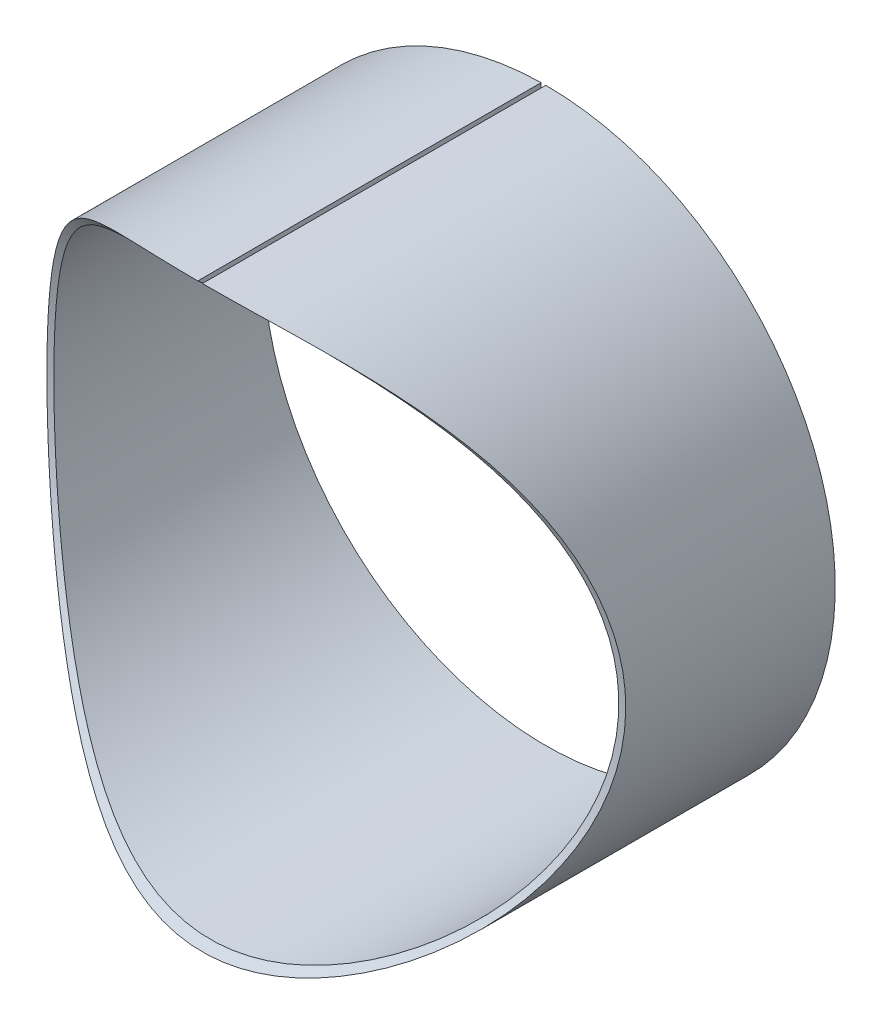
ISO-10303-21;
HEADER;
FILE_DESCRIPTION(('STEP AP214'),'2;1');
FILE_NAME('part.step','',(''),(''),'','','');
FILE_SCHEMA(('AUTOMOTIVE_DESIGN { 1 0 10303 214 1 1 1 1 }'));
ENDSEC;
DATA;
#1=APPLICATION_CONTEXT('core data for automotive mechanical design processes');
#2=APPLICATION_PROTOCOL_DEFINITION('international standard','automotive_design',2000,#1);
#3=PRODUCT_CONTEXT('',#1,'mechanical');
#4=PRODUCT('Part','Part','',(#3));
#5=PRODUCT_RELATED_PRODUCT_CATEGORY('part','',(#4));
#6=PRODUCT_DEFINITION_FORMATION('','',#4);
#7=PRODUCT_DEFINITION_CONTEXT('part definition',#1,'design');
#8=PRODUCT_DEFINITION('design','',#6,#7);
#9=PRODUCT_DEFINITION_SHAPE('','',#8);
#10=(LENGTH_UNIT() NAMED_UNIT(*) SI_UNIT(.MILLI.,.METRE.));
#11=(NAMED_UNIT(*) PLANE_ANGLE_UNIT() SI_UNIT($,.RADIAN.));
#12=(NAMED_UNIT(*) SI_UNIT($,.STERADIAN.) SOLID_ANGLE_UNIT());
#13=UNCERTAINTY_MEASURE_WITH_UNIT(LENGTH_MEASURE(1.E-05),#10,'distance_accuracy_value','');
#14=(GEOMETRIC_REPRESENTATION_CONTEXT(3) GLOBAL_UNCERTAINTY_ASSIGNED_CONTEXT((#13)) GLOBAL_UNIT_ASSIGNED_CONTEXT((#10,
#11,#12)) REPRESENTATION_CONTEXT('',''));
#15=CARTESIAN_POINT('',(0.,0.,0.));
#16=DIRECTION('',(0.,0.,1.));
#17=DIRECTION('',(1.,0.,0.));
#18=AXIS2_PLACEMENT_3D('',#15,#16,#17);
#19=CARTESIAN_POINT('',(0.,-79.9999999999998,0.));
#20=DIRECTION('',(0.,0.,1.));
#21=DIRECTION('',(1.,0.,0.));
#22=AXIS2_PLACEMENT_3D('',#19,#20,#21);
#23=PLANE('',#22);
#24=CARTESIAN_POINT('',(0.,-79.9999999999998,0.));
#25=DIRECTION('',(0.,0.,1.));
#26=DIRECTION('',(1.,0.,0.));
#27=AXIS2_PLACEMENT_3D('',#24,#25,#26);
#28=CIRCLE('',#27,61.);
#29=CARTESIAN_POINT('',(-1.,-19.0081972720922,0.));
#30=VERTEX_POINT('',#29);
#31=CARTESIAN_POINT('',(0.,-18.9999999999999,0.));
#32=VERTEX_POINT('',#31);
#33=EDGE_CURVE('E90',#30,#32,#28,.T.);
#34=ORIENTED_EDGE('',*,*,#33,.T.);
#35=DIRECTION('',(0.,-1.,0.));
#36=VECTOR('',#35,1.);
#37=CARTESIAN_POINT('',(0.,-79.9999999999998,0.));
#38=LINE('',#37,#36);
#39=CARTESIAN_POINT('',(0.,-17.4999999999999,0.));
#40=VERTEX_POINT('',#39);
#41=EDGE_CURVE('E93',#40,#32,#38,.T.);
#42=ORIENTED_EDGE('',*,*,#41,.F.);
#43=CARTESIAN_POINT('',(0.,-79.9999999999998,0.));
#44=DIRECTION('',(0.,0.,1.));
#45=DIRECTION('',(1.,0.,0.));
#46=AXIS2_PLACEMENT_3D('',#43,#44,#45);
#47=CIRCLE('',#46,62.5);
#48=CARTESIAN_POINT('',(-1.,-17.5080005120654,0.));
#49=VERTEX_POINT('',#48);
#50=EDGE_CURVE('E92',#49,#40,#47,.T.);
#51=ORIENTED_EDGE('',*,*,#50,.F.);
#52=DIRECTION('',(0.,1.,0.));
#53=VECTOR('',#52,1.);
#54=CARTESIAN_POINT('',(-1.,-79.9999999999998,0.));
#55=LINE('',#54,#53);
#56=EDGE_CURVE('E80',#30,#49,#55,.T.);
#57=ORIENTED_EDGE('',*,*,#56,.F.);
#58=EDGE_LOOP('',(#34,#42,#51,#57));
#59=FACE_BOUND('',#58,.T.);
#60=ADVANCED_FACE('F38',(#59),#23,.F.);
#61=CARTESIAN_POINT('',(0.,-79.9999999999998,127.235502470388));
#62=DIRECTION('',(0.,0.,-1.));
#63=DIRECTION('',(-1.,0.,0.));
#64=AXIS2_PLACEMENT_3D('',#61,#62,#63);
#65=CYLINDRICAL_SURFACE('',#64,62.5);
#66=ORIENTED_EDGE('',*,*,#50,.T.);
#67=DIRECTION('',(0.,0.,-1.));
#68=VECTOR('',#67,1.);
#69=CARTESIAN_POINT('',(0.,-17.4999999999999,127.235502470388));
#70=LINE('',#69,#68);
#71=CARTESIAN_POINT('',(0.,-17.4999999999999,74.1520194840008));
#72=VERTEX_POINT('',#71);
#73=EDGE_CURVE('E97',#40,#72,#70,.F.);
#74=ORIENTED_EDGE('',*,*,#73,.T.);
#75=CARTESIAN_POINT('',(-62.5,-79.9999999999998,45.234502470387));
#76=CARTESIAN_POINT('',(-62.4999996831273,-79.2396670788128,45.234502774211));
#77=CARTESIAN_POINT('',(-62.4861200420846,-78.4793250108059,45.2450831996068));
#78=CARTESIAN_POINT('',(-62.4306589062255,-76.9601555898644,45.287343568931));
#79=CARTESIAN_POINT('',(-62.3890741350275,-76.2013284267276,45.3190260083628));
#80=CARTESIAN_POINT('',(-62.2783644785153,-74.6866054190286,45.4033140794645));
#81=CARTESIAN_POINT('',(-62.2092306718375,-73.9307106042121,45.4559264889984));
#82=CARTESIAN_POINT('',(-62.0437126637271,-72.4235548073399,45.5817658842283));
#83=CARTESIAN_POINT('',(-61.9473254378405,-71.6722943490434,45.6549951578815));
#84=CARTESIAN_POINT('',(-61.7275392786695,-70.1748039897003,45.8217640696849));
#85=CARTESIAN_POINT('',(-61.6040986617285,-69.4285837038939,45.9153350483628));
#86=CARTESIAN_POINT('',(-61.3307846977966,-67.9436799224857,46.122190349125));
#87=CARTESIAN_POINT('',(-61.180908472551,-67.2049972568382,46.2354768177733));
#88=CARTESIAN_POINT('',(-60.8553509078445,-65.7367064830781,46.4810981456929));
#89=CARTESIAN_POINT('',(-60.6796751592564,-65.007096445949,46.6134288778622));
#90=CARTESIAN_POINT('',(-60.3031549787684,-63.5579737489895,46.8964347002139));
#91=CARTESIAN_POINT('',(-60.1023079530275,-62.8384621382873,47.0471116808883));
#92=CARTESIAN_POINT('',(-59.4656531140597,-60.7054989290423,47.523558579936));
#93=CARTESIAN_POINT('',(-58.9936715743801,-59.3083855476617,47.8753046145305));
#94=CARTESIAN_POINT('',(-57.9590827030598,-56.5661879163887,48.6413444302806));
#95=CARTESIAN_POINT('',(-57.3964734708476,-55.2211047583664,49.0556395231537));
#96=CARTESIAN_POINT('',(-56.186943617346,-52.5887873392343,49.9392754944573));
#97=CARTESIAN_POINT('',(-55.5400489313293,-51.3015354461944,50.408599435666));
#98=CARTESIAN_POINT('',(-54.1678011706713,-48.7886354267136,51.3947172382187));
#99=CARTESIAN_POINT('',(-53.4424448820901,-47.5629898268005,51.9115130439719));
#100=CARTESIAN_POINT('',(-51.8477055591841,-45.0648967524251,53.0348742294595));
#101=CARTESIAN_POINT('',(-50.9711993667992,-43.7987436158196,53.6453167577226));
#102=CARTESIAN_POINT('',(-49.1372999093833,-41.3461405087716,54.9034646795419));
#103=CARTESIAN_POINT('',(-48.1799023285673,-40.1596947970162,55.5511720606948));
#104=CARTESIAN_POINT('',(-46.1881333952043,-37.8666884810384,56.8744375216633));
#105=CARTESIAN_POINT('',(-45.1536599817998,-36.7602377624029,57.5500319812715));
#106=CARTESIAN_POINT('',(-43.0127936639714,-34.6300762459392,58.917800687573));
#107=CARTESIAN_POINT('',(-41.9063972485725,-33.6063694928,59.6099757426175));
#108=CARTESIAN_POINT('',(-40.0755370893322,-32.0309468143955,60.7251070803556));
#109=CARTESIAN_POINT('',(-39.3728446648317,-31.4525246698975,61.1464029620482));
#110=CARTESIAN_POINT('',(-37.9425726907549,-30.3266718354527,61.9883956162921));
#111=CARTESIAN_POINT('',(-37.2149917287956,-29.7792429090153,62.4090923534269));
#112=CARTESIAN_POINT('',(-35.7350617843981,-28.7156355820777,63.2472179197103));
#113=CARTESIAN_POINT('',(-34.9827044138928,-28.1994679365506,63.664645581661));
#114=CARTESIAN_POINT('',(-33.4537055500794,-27.1991085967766,64.4930684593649));
#115=CARTESIAN_POINT('',(-32.6770666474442,-26.7149135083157,64.9040643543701));
#116=CARTESIAN_POINT('',(-31.1001722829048,-25.779441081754,65.7160964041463));
#117=CARTESIAN_POINT('',(-30.2999370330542,-25.3281366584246,66.1171405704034));
#118=CARTESIAN_POINT('',(-28.675241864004,-24.4587594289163,66.9061080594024));
#119=CARTESIAN_POINT('',(-27.8507811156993,-24.0406877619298,67.2940309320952));
#120=CARTESIAN_POINT('',(-26.1780964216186,-23.2389485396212,68.0526855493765));
#121=CARTESIAN_POINT('',(-25.329884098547,-22.8552645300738,68.4234254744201));
#122=CARTESIAN_POINT('',(-23.6095988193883,-22.123315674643,69.1435992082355));
#123=CARTESIAN_POINT('',(-22.7375286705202,-21.7750466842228,69.4930355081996));
#124=CARTESIAN_POINT('',(-20.7061923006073,-21.0169243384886,70.2663464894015));
#125=CARTESIAN_POINT('',(-19.5387859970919,-20.6196471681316,70.6813718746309));
#126=CARTESIAN_POINT('',(-17.165998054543,-19.8907766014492,71.4566882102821));
#127=CARTESIAN_POINT('',(-15.9606219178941,-19.5591737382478,71.8169870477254));
#128=CARTESIAN_POINT('',(-13.5171941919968,-18.9663088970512,72.4706146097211));
#129=CARTESIAN_POINT('',(-12.279213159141,-18.7049068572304,72.7640765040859));
#130=CARTESIAN_POINT('',(-10.4006924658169,-18.3681826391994,73.1461703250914));
#131=CARTESIAN_POINT('',(-9.77083487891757,-18.2651601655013,73.2638645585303));
#132=CARTESIAN_POINT('',(-8.50484647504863,-18.0780588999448,73.4786323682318));
#133=CARTESIAN_POINT('',(-7.86871639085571,-17.9939779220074,73.5757083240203));
#134=CARTESIAN_POINT('',(-6.58461862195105,-17.8444291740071,73.7490067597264));
#135=CARTESIAN_POINT('',(-5.93659662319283,-17.7791639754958,73.825001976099));
#136=CARTESIAN_POINT('',(-4.63661252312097,-17.6688097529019,73.9538311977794));
#137=CARTESIAN_POINT('',(-3.98465091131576,-17.6237182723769,74.006668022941));
#138=CARTESIAN_POINT('',(-2.67807370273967,-17.5539756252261,74.0885060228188));
#139=CARTESIAN_POINT('',(-2.02345785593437,-17.5293264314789,74.1175048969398));
#140=CARTESIAN_POINT('',(-0.713223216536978,-17.5006348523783,74.1512673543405));
#141=CARTESIAN_POINT('',(-0.0576045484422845,-17.4965900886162,74.1560337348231));
#142=CARTESIAN_POINT('',(1.25333302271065,-17.5091291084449,74.1412717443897));
#143=CARTESIAN_POINT('',(1.90865180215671,-17.5257182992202,74.1217370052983));
#144=CARTESIAN_POINT('',(3.21725416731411,-17.5794255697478,74.0586283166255));
#145=CARTESIAN_POINT('',(3.87053783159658,-17.6165428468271,74.0150553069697));
#146=CARTESIAN_POINT('',(5.17361279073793,-17.7110731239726,73.9044463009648));
#147=CARTESIAN_POINT('',(5.82340423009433,-17.7684852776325,73.8374112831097));
#148=CARTESIAN_POINT('',(7.11819315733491,-17.9032594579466,73.6807407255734));
#149=CARTESIAN_POINT('',(7.76319019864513,-17.9806233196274,73.5911031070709));
#150=CARTESIAN_POINT('',(9.53656887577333,-18.2213090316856,73.3137388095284));
#151=CARTESIAN_POINT('',(10.6587197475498,-18.4052064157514,73.103320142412));
#152=CARTESIAN_POINT('',(12.8789517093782,-18.8308818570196,72.6227678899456));
#153=CARTESIAN_POINT('',(13.9770297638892,-19.0726671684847,72.3526268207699));
#154=CARTESIAN_POINT('',(15.6035792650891,-19.476525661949,71.9086582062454));
#155=CARTESIAN_POINT('',(16.1425907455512,-19.6180871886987,71.7541248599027));
#156=CARTESIAN_POINT('',(17.213218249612,-19.914531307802,71.4332104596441));
#157=CARTESIAN_POINT('',(17.7448360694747,-20.0694105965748,71.2668323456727));
#158=CARTESIAN_POINT('',(19.3286724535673,-20.5536243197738,70.7513137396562));
#159=CARTESIAN_POINT('',(20.3697092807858,-20.9024935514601,70.3858345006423));
#160=CARTESIAN_POINT('',(22.2383365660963,-21.583286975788,69.6872911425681));
#161=CARTESIAN_POINT('',(23.0710346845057,-21.907241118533,69.3599756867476));
#162=CARTESIAN_POINT('',(24.7148904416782,-22.5873245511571,68.6852574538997));
#163=CARTESIAN_POINT('',(25.5260478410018,-22.9434541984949,68.3378544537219));
#164=CARTESIAN_POINT('',(27.1270137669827,-23.6869947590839,67.6265307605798));
#165=CARTESIAN_POINT('',(27.9168114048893,-24.0744212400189,67.2626018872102));
#166=CARTESIAN_POINT('',(29.4745699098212,-24.8795101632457,66.5218114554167));
#167=CARTESIAN_POINT('',(30.2425313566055,-25.297171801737,66.1449502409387));
#168=CARTESIAN_POINT('',(31.7581854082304,-26.1629225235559,65.3806169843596));
#169=CARTESIAN_POINT('',(32.5058329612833,-26.6110725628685,64.9931246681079));
#170=CARTESIAN_POINT('',(33.9791723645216,-27.5364637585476,64.2111368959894));
#171=CARTESIAN_POINT('',(34.7048622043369,-28.0137075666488,63.8166408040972));
#172=CARTESIAN_POINT('',(36.8484479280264,-29.4881170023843,62.6268942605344));
#173=CARTESIAN_POINT('',(38.2334653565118,-30.5283071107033,61.8250759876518));
#174=CARTESIAN_POINT('',(40.9530894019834,-32.7530689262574,60.1995652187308));
#175=CARTESIAN_POINT('',(42.2849590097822,-33.9410224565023,59.375933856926));
#176=CARTESIAN_POINT('',(44.8488769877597,-36.433676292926,57.7493221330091));
#177=CARTESIAN_POINT('',(46.0809152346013,-37.7383884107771,56.9463438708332));
#178=CARTESIAN_POINT('',(48.4364247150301,-40.4601907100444,55.3800300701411));
#179=CARTESIAN_POINT('',(49.5600696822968,-41.8770942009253,54.6166320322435));
#180=CARTESIAN_POINT('',(51.6920034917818,-44.8220348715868,53.1452417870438));
#181=CARTESIAN_POINT('',(52.7003195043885,-46.3500457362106,52.4372365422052));
#182=CARTESIAN_POINT('',(54.4114237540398,-49.2124152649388,51.2209286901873));
#183=CARTESIAN_POINT('',(55.1358941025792,-50.5285669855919,50.7002129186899));
#184=CARTESIAN_POINT('',(56.4952754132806,-53.2265933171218,49.7151714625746));
#185=CARTESIAN_POINT('',(57.1301956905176,-54.6084610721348,49.2508399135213));
#186=CARTESIAN_POINT('',(58.3033010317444,-57.4320994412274,48.3873894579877));
#187=CARTESIAN_POINT('',(58.8415226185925,-58.8738471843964,47.9882459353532));
#188=CARTESIAN_POINT('',(59.5710711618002,-61.075515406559,47.4445504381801));
#189=CARTESIAN_POINT('',(59.8013195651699,-61.816029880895,47.2724662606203));
#190=CARTESIAN_POINT('',(60.2350743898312,-63.3089916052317,46.9475577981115));
#191=CARTESIAN_POINT('',(60.4385837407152,-64.0614375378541,46.7947314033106));
#192=CARTESIAN_POINT('',(60.8193992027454,-65.5823175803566,46.5082149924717));
#193=CARTESIAN_POINT('',(60.9965119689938,-66.3508267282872,46.3746663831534));
#194=CARTESIAN_POINT('',(61.3220659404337,-67.8971733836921,46.1288036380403));
#195=CARTESIAN_POINT('',(61.4705105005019,-68.675009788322,46.0164870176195));
#196=CARTESIAN_POINT('',(61.7381190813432,-70.2386534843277,45.8137574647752));
#197=CARTESIAN_POINT('',(61.8572790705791,-71.0244618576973,45.7233475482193));
#198=CARTESIAN_POINT('',(62.0657354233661,-72.6021915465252,45.5650411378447));
#199=CARTESIAN_POINT('',(62.1550354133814,-73.3941121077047,45.497141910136));
#200=CARTESIAN_POINT('',(62.3033478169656,-74.9821688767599,45.3843049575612));
#201=CARTESIAN_POINT('',(62.3623695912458,-75.7783037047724,45.3393601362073));
#202=CARTESIAN_POINT('',(62.4498779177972,-77.3731291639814,45.272703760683));
#203=CARTESIAN_POINT('',(62.4783680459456,-78.1718194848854,45.2509894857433));
#204=CARTESIAN_POINT('',(62.5046860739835,-79.7699815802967,45.2309311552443));
#205=CARTESIAN_POINT('',(62.5025146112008,-80.5694533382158,45.2325866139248));
#206=CARTESIAN_POINT('',(62.4675221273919,-82.1673180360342,45.2592550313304));
#207=CARTESIAN_POINT('',(62.4347018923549,-82.9657110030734,45.2842673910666));
#208=CARTESIAN_POINT('',(62.3438867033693,-84.4714676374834,45.3534335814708));
#209=CARTESIAN_POINT('',(62.2890761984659,-85.1791364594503,45.3951654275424));
#210=CARTESIAN_POINT('',(62.1555524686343,-86.5909270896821,45.4967457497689));
#211=CARTESIAN_POINT('',(62.0768372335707,-87.2950485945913,45.5565957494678));
#212=CARTESIAN_POINT('',(61.8052640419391,-89.3999672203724,45.7628729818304));
#213=CARTESIAN_POINT('',(61.576947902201,-90.793823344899,45.9360509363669));
#214=CARTESIAN_POINT('',(61.0290357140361,-93.5531021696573,46.3502569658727));
#215=CARTESIAN_POINT('',(60.7094291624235,-94.9185215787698,46.5912928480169));
#216=CARTESIAN_POINT('',(59.9831317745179,-97.6130897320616,47.13663375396));
#217=CARTESIAN_POINT('',(59.5764368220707,-98.9422367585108,47.4409417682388));
#218=CARTESIAN_POINT('',(58.6700576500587,-101.588833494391,48.1154035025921));
#219=CARTESIAN_POINT('',(58.1683788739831,-102.905239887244,48.4869601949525));
#220=CARTESIAN_POINT('',(57.0842469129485,-105.487241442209,49.2843493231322));
#221=CARTESIAN_POINT('',(56.5017933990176,-106.752836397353,49.7101819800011));
#222=CARTESIAN_POINT('',(55.2615889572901,-109.228824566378,50.6093706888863));
#223=CARTESIAN_POINT('',(54.6038406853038,-110.43921972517,51.0827250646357));
#224=CARTESIAN_POINT('',(53.218028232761,-112.801942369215,52.0702020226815));
#225=CARTESIAN_POINT('',(52.4899547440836,-113.954262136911,52.5843300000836));
#226=CARTESIAN_POINT('',(51.2865363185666,-115.729028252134,53.4242155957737));
#227=CARTESIAN_POINT('',(50.8328035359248,-116.37157410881,53.7388538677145));
#228=CARTESIAN_POINT('',(49.9040644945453,-117.635745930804,54.378121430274));
#229=CARTESIAN_POINT('',(49.4290624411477,-118.257375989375,54.7027487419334));
#230=CARTESIAN_POINT('',(47.9730061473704,-120.090860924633,55.6897666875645));
#231=CARTESIAN_POINT('',(46.9609208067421,-121.271282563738,56.3652799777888));
#232=CARTESIAN_POINT('',(44.8576568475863,-123.548224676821,57.7411544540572));
#233=CARTESIAN_POINT('',(43.7663366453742,-124.64458738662,58.4415589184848));
#234=CARTESIAN_POINT('',(41.5097700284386,-126.750082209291,59.8547087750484));
#235=CARTESIAN_POINT('',(40.3445209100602,-127.759211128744,60.5674546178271));
#236=CARTESIAN_POINT('',(38.4225207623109,-129.303303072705,61.7081427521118));
#237=CARTESIAN_POINT('',(37.6884509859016,-129.866700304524,62.1361629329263));
#238=CARTESIAN_POINT('',(36.1948605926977,-130.961154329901,62.98933142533));
#239=CARTESIAN_POINT('',(35.4353391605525,-131.492210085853,63.4144796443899));
#240=CARTESIAN_POINT('',(33.8908391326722,-132.521639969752,64.2589457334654));
#241=CARTESIAN_POINT('',(33.1058514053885,-133.020002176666,64.6782614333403));
#242=CARTESIAN_POINT('',(31.5107865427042,-133.983222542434,65.5075592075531));
#243=CARTESIAN_POINT('',(30.7007098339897,-134.448081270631,65.9175414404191));
#244=CARTESIAN_POINT('',(29.0568818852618,-135.342766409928,66.7238403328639));
#245=CARTESIAN_POINT('',(28.223172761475,-135.772650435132,67.1201788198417));
#246=CARTESIAN_POINT('',(26.530785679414,-136.597292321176,67.8959234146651));
#247=CARTESIAN_POINT('',(25.6721066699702,-136.992048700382,68.2753288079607));
#248=CARTESIAN_POINT('',(23.9305141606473,-137.744954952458,69.0125343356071));
#249=CARTESIAN_POINT('',(23.047617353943,-138.103129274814,69.3703488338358));
#250=CARTESIAN_POINT('',(21.257432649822,-138.781696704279,70.0598041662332));
#251=CARTESIAN_POINT('',(20.3501455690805,-139.102091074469,70.3914458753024));
#252=CARTESIAN_POINT('',(18.2953116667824,-139.774232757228,71.0977813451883));
#253=CARTESIAN_POINT('',(17.1414814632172,-140.115607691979,71.4642333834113));
#254=CARTESIAN_POINT('',(14.8001567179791,-140.734430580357,72.1387792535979));
#255=CARTESIAN_POINT('',(13.6126677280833,-141.011889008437,72.4468826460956));
#256=CARTESIAN_POINT('',(11.210586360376,-141.498543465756,72.9937134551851));
#257=CARTESIAN_POINT('',(9.99605598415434,-141.707881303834,73.2325848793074));
#258=CARTESIAN_POINT('',(7.5439976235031,-142.055386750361,73.6322682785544));
#259=CARTESIAN_POINT('',(6.3064697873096,-142.193554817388,73.793080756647));
#260=CARTESIAN_POINT('',(3.80751479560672,-142.396602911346,74.0302838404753));
#261=CARTESIAN_POINT('',(2.54597681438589,-142.46090769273,74.1060117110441));
#262=CARTESIAN_POINT('',(0.0191570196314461,-142.51276988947,74.1670426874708));
#263=CARTESIAN_POINT('',(-1.24612464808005,-142.5003302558,74.1523492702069));
#264=CARTESIAN_POINT('',(-3.77031434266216,-142.398970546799,74.0332390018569));
#265=CARTESIAN_POINT('',(-5.02921658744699,-142.309990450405,73.9287517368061));
#266=CARTESIAN_POINT('',(-7.52950056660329,-142.057523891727,73.6350551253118));
#267=CARTESIAN_POINT('',(-8.77088001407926,-141.894027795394,73.4458348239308));
#268=CARTESIAN_POINT('',(-11.410977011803,-141.466123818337,72.9571023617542));
#269=CARTESIAN_POINT('',(-12.8055711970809,-141.190308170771,72.6453558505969));
#270=CARTESIAN_POINT('',(-15.5520628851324,-140.550583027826,71.9366370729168));
#271=CARTESIAN_POINT('',(-16.9039521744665,-140.186656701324,71.5396485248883));
#272=CARTESIAN_POINT('',(-19.5628512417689,-139.375763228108,70.6759478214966));
#273=CARTESIAN_POINT('',(-20.8697576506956,-138.928618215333,70.209086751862));
#274=CARTESIAN_POINT('',(-23.4335021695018,-137.956886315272,69.2217556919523));
#275=CARTESIAN_POINT('',(-24.690336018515,-137.432292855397,68.7012811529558));
#276=CARTESIAN_POINT('',(-26.7828204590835,-136.478547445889,67.7830853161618));
#277=CARTESIAN_POINT('',(-27.6315516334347,-136.068081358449,67.3954714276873));
#278=CARTESIAN_POINT('',(-29.3041084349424,-135.212332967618,66.6049924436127));
#279=CARTESIAN_POINT('',(-30.1279320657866,-134.767047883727,66.202126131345));
#280=CARTESIAN_POINT('',(-31.7507766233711,-133.842460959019,65.3849249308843));
#281=CARTESIAN_POINT('',(-32.5497898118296,-133.363148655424,64.9705865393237));
#282=CARTESIAN_POINT('',(-34.1226798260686,-132.371338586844,64.1340765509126));
#283=CARTESIAN_POINT('',(-34.8965572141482,-131.858841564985,63.7119051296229));
#284=CARTESIAN_POINT('',(-36.419753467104,-130.800711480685,62.8625488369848));
#285=CARTESIAN_POINT('',(-37.1690488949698,-130.255048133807,62.4353596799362));
#286=CARTESIAN_POINT('',(-38.6421275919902,-129.131397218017,61.5793065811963));
#287=CARTESIAN_POINT('',(-39.3659085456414,-128.553406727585,61.1504424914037));
#288=CARTESIAN_POINT('',(-40.7873775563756,-127.36557328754,60.2939433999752));
#289=CARTESIAN_POINT('',(-41.4850699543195,-126.755735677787,59.8663082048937));
#290=CARTESIAN_POINT('',(-42.8538528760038,-125.504472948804,59.0148879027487));
#291=CARTESIAN_POINT('',(-43.524943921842,-124.863048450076,58.5911027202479));
#292=CARTESIAN_POINT('',(-45.5189097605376,-122.870150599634,57.31552084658));
#293=CARTESIAN_POINT('',(-46.7993704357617,-121.469312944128,56.4735567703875));
#294=CARTESIAN_POINT('',(-49.2396799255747,-118.540066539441,54.8364484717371));
#295=CARTESIAN_POINT('',(-50.3995128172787,-117.011640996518,54.041310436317));
#296=CARTESIAN_POINT('',(-52.0389403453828,-114.628407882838,52.8997964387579));
#297=CARTESIAN_POINT('',(-52.5683345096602,-113.819541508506,52.5280849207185));
#298=CARTESIAN_POINT('',(-53.5925238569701,-112.171913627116,51.8038897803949));
#299=CARTESIAN_POINT('',(-54.0873237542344,-111.333156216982,51.4514035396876));
#300=CARTESIAN_POINT('',(-55.0404543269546,-109.626896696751,50.7682271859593));
#301=CARTESIAN_POINT('',(-55.4987960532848,-108.759403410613,50.4375304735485));
#302=CARTESIAN_POINT('',(-56.3772558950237,-106.996753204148,49.8003135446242));
#303=CARTESIAN_POINT('',(-56.7973775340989,-106.101598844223,49.4937910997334));
#304=CARTESIAN_POINT('',(-57.7756984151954,-103.880450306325,48.7767026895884));
#305=CARTESIAN_POINT('',(-58.3121010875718,-102.540067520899,48.3805697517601));
#306=CARTESIAN_POINT('',(-59.2951488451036,-99.8100772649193,47.6508599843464));
#307=CARTESIAN_POINT('',(-59.7417991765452,-98.4204726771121,47.3172794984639));
#308=CARTESIAN_POINT('',(-60.3397160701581,-96.3065683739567,46.8689988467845));
#309=CARTESIAN_POINT('',(-60.5268744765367,-95.5976749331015,46.7283578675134));
#310=CARTESIAN_POINT('',(-60.8767837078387,-94.170626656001,46.4649569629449));
#311=CARTESIAN_POINT('',(-61.0395369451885,-93.4524727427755,46.3421952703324));
#312=CARTESIAN_POINT('',(-61.3400003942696,-92.0082586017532,46.1152324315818));
#313=CARTESIAN_POINT('',(-61.477717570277,-91.2822006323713,46.011026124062));
#314=CARTESIAN_POINT('',(-61.7276296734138,-89.8233060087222,45.8217049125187));
#315=CARTESIAN_POINT('',(-61.83982739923,-89.0904701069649,45.7365879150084));
#316=CARTESIAN_POINT('',(-62.0320848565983,-87.6651705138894,45.5906056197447));
#317=CARTESIAN_POINT('',(-62.1137122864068,-86.9730387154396,45.5285590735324));
#318=CARTESIAN_POINT('',(-62.253844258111,-85.5852604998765,45.4219786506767));
#319=CARTESIAN_POINT('',(-62.3123544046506,-84.8896149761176,45.3774405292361));
#320=CARTESIAN_POINT('',(-62.4060751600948,-83.4956892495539,45.3060745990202));
#321=CARTESIAN_POINT('',(-62.4412804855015,-82.7974084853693,45.2792508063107));
#322=CARTESIAN_POINT('',(-62.4882461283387,-81.3994212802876,45.2434622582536));
#323=CARTESIAN_POINT('',(-62.5000002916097,-80.6997145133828,45.2345021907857));
#324=CARTESIAN_POINT('',(-62.5,-79.9999999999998,45.234502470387));
#325=B_SPLINE_CURVE_WITH_KNOTS('',3,(#75,#76,#77,#78,#79,#80,#81,#82,#83,#84,#85,#86,#87,#88,
#89,#90,#91,#92,#93,#94,#95,#96,#97,#98,#99,#100,#101,#102,#103,#104,#105,#106,#107,#108,#109,
#110,#111,#112,#113,#114,#115,#116,#117,#118,#119,#120,#121,#122,#123,#124,#125,#126,#127,#128,
#129,#130,#131,#132,#133,#134,#135,#136,#137,#138,#139,#140,#141,#142,#143,#144,#145,#146,#147,
#148,#149,#150,#151,#152,#153,#154,#155,#156,#157,#158,#159,#160,#161,#162,#163,#164,#165,#166,
#167,#168,#169,#170,#171,#172,#173,#174,#175,#176,#177,#178,#179,#180,#181,#182,#183,#184,#185,
#186,#187,#188,#189,#190,#191,#192,#193,#194,#195,#196,#197,#198,#199,#200,#201,#202,#203,#204,
#205,#206,#207,#208,#209,#210,#211,#212,#213,#214,#215,#216,#217,#218,#219,#220,#221,#222,#223,
#224,#225,#226,#227,#228,#229,#230,#231,#232,#233,#234,#235,#236,#237,#238,#239,#240,#241,#242,
#243,#244,#245,#246,#247,#248,#249,#250,#251,#252,#253,#254,#255,#256,#257,#258,#259,#260,#261,
#262,#263,#264,#265,#266,#267,#268,#269,#270,#271,#272,#273,#274,#275,#276,#277,#278,#279,#280,
#281,#282,#283,#284,#285,#286,#287,#288,#289,#290,#291,#292,#293,#294,#295,#296,#297,#298,#299,
#300,#301,#302,#303,#304,#305,#306,#307,#308,#309,#310,#311,#312,#313,#314,#315,#316,#317,#318,
#319,#320,#321,#322,#323,#324),.UNSPECIFIED.,.T.,.F.,(4,2,2,2,2,2,2,2,2,2,2,2,2,2,2,2,2,2,2,2,2,
2,2,2,2,2,2,2,2,2,2,2,2,2,2,2,2,2,2,2,2,2,2,2,2,2,2,2,2,2,2,2,2,2,2,2,2,2,2,2,2,2,2,2,2,2,2,2,2,
2,2,2,2,2,2,2,2,2,2,2,2,2,2,2,2,2,2,2,2,2,2,2,2,2,2,2,2,2,2,2,2,2,2,2,2,2,2,2,2,2,2,2,2,2,2,2,2,
2,2,2,2,2,2,2,4),(0.,2.2808148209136,4.56189941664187,6.84372331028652,9.1258005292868,
11.4114189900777,13.6972864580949,15.9826592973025,18.26826783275,22.8108132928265,
27.3534540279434,31.8947002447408,36.4361325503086,41.4010767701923,46.3662860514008,
51.3381910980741,56.3103390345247,59.318395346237,62.3266226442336,65.3358790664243,
68.3448155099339,71.3512454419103,74.3577783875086,77.3628649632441,80.367599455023,
84.2677581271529,88.1673541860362,92.0591111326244,94.0055517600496,95.9517676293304,
97.9182145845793,99.8844220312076,101.850819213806,103.816989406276,105.783674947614,
107.750283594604,109.716810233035,111.683517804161,115.149077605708,118.615071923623,
120.349751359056,122.084001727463,125.553028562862,128.406750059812,131.260503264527,
134.115684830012,136.970790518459,139.831782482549,142.693035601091,148.413258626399,
154.304151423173,160.195640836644,166.077524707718,171.958019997,176.723661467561,
181.488806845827,186.25214863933,188.634555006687,191.016700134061,193.415516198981,
195.814051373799,198.212916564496,200.611490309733,203.009322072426,205.406872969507,
207.80437403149,210.201813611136,212.334195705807,214.466757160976,218.730365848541,
222.994465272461,227.258766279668,231.625240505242,235.991732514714,240.358070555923,
244.724987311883,247.266032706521,249.806577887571,254.887777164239,259.978290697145,
265.068990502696,268.126909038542,271.184925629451,274.244051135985,277.303124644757,
280.357052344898,283.411108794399,286.463110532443,289.515010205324,293.285296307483,
297.054964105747,300.816733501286,304.578478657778,308.369325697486,312.16002697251,
315.953703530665,319.747870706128,324.107491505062,328.467945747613,332.837829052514,
337.208083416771,340.265173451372,343.322507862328,346.380786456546,349.438996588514,
352.500042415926,355.561365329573,358.622176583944,361.682927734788,367.903737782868,
374.125367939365,377.23150350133,380.337214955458,383.441981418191,386.546461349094,
391.033046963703,395.519370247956,397.758465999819,399.997340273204,402.235590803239,
404.473595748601,406.572053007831,408.670001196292,410.768424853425,412.867399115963),.UNSPECIFIED.);
#326=CARTESIAN_POINT('',(-1.,-17.5080005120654,74.1426010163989));
#327=VERTEX_POINT('',#326);
#328=EDGE_CURVE('E96',#72,#327,#325,.T.);
#329=ORIENTED_EDGE('',*,*,#328,.T.);
#330=DIRECTION('',(0.,0.,-1.));
#331=VECTOR('',#330,1.);
#332=CARTESIAN_POINT('',(-1.,-17.5080005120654,127.235502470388));
#333=LINE('',#332,#331);
#334=EDGE_CURVE('E54',#327,#49,#333,.T.);
#335=ORIENTED_EDGE('',*,*,#334,.T.);
#336=EDGE_LOOP('',(#66,#74,#329,#335));
#337=FACE_BOUND('',#336,.T.);
#338=ADVANCED_FACE('F111',(#337),#65,.T.);
#339=CARTESIAN_POINT('',(0.,-79.9999999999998,127.235502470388));
#340=DIRECTION('',(0.,0.,-1.));
#341=DIRECTION('',(-1.,0.,0.));
#342=AXIS2_PLACEMENT_3D('',#339,#340,#341);
#343=CYLINDRICAL_SURFACE('',#342,61.);
#344=DIRECTION('',(0.,0.,-1.));
#345=VECTOR('',#344,1.);
#346=CARTESIAN_POINT('',(0.,-18.9999999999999,127.235502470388));
#347=LINE('',#346,#345);
#348=CARTESIAN_POINT('',(0.,-18.9999999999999,72.4348674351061));
#349=VERTEX_POINT('',#348);
#350=EDGE_CURVE('E62',#32,#349,#347,.F.);
#351=ORIENTED_EDGE('',*,*,#350,.F.);
#352=ORIENTED_EDGE('',*,*,#33,.F.);
#353=DIRECTION('',(0.,0.,-1.));
#354=VECTOR('',#353,1.);
#355=CARTESIAN_POINT('',(-1.,-19.0081972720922,127.235502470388));
#356=LINE('',#355,#354);
#357=CARTESIAN_POINT('',(-1.,-19.0081972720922,72.4257440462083));
#358=VERTEX_POINT('',#357);
#359=EDGE_CURVE('E77',#358,#30,#356,.T.);
#360=ORIENTED_EDGE('',*,*,#359,.F.);
#361=CARTESIAN_POINT('',(-61.,-79.9999999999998,45.234502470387));
#362=CARTESIAN_POINT('',(-60.9999993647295,-79.253761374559,45.234503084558));
#363=CARTESIAN_POINT('',(-60.9863008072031,-78.5074994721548,45.2446949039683));
#364=CARTESIAN_POINT('',(-60.9315608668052,-77.0164526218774,45.2854037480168));
#365=CARTESIAN_POINT('',(-60.8905159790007,-76.271667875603,45.3159233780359));
#366=CARTESIAN_POINT('',(-60.7812267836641,-74.7847862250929,45.3971259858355));
#367=CARTESIAN_POINT('',(-60.7129675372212,-74.0426910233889,45.4478200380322));
#368=CARTESIAN_POINT('',(-60.5495292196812,-72.5630236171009,45.569072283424));
#369=CARTESIAN_POINT('',(-60.4543471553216,-71.8254519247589,45.6396326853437));
#370=CARTESIAN_POINT('',(-60.2372057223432,-70.3546415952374,45.8003842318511));
#371=CARTESIAN_POINT('',(-60.1151844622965,-69.6214170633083,45.8906207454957));
#372=CARTESIAN_POINT('',(-59.8449699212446,-68.1623420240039,46.0901118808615));
#373=CARTESIAN_POINT('',(-59.6967737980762,-67.4364923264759,46.1993685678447));
#374=CARTESIAN_POINT('',(-59.3748280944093,-65.9937198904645,46.4362455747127));
#375=CARTESIAN_POINT('',(-59.2010855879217,-65.2767947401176,46.5638608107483));
#376=CARTESIAN_POINT('',(-58.8286569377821,-63.8528330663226,46.8367731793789));
#377=CARTESIAN_POINT('',(-58.6299682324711,-63.1457975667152,46.9820721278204));
#378=CARTESIAN_POINT('',(-58.000136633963,-61.0500067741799,47.4414371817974));
#379=CARTESIAN_POINT('',(-57.5331371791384,-59.6772525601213,47.7805164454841));
#380=CARTESIAN_POINT('',(-56.5091554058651,-56.9827485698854,48.5188185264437));
#381=CARTESIAN_POINT('',(-55.9521698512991,-55.6610006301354,48.9180435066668));
#382=CARTESIAN_POINT('',(-54.7544908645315,-53.0746328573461,49.7691758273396));
#383=CARTESIAN_POINT('',(-54.1138434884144,-51.8099821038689,50.2210541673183));
#384=CARTESIAN_POINT('',(-52.7544087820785,-49.341257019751,51.1701165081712));
#385=CARTESIAN_POINT('',(-52.035618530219,-48.1371849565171,51.6673022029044));
#386=CARTESIAN_POINT('',(-50.4556083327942,-45.6845335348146,52.7468828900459));
#387=CARTESIAN_POINT('',(-49.5873671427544,-44.4420781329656,53.3329079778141));
#388=CARTESIAN_POINT('',(-47.7701345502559,-42.0357016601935,54.5397698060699));
#389=CARTESIAN_POINT('',(-46.8211388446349,-40.8717847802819,55.1606084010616));
#390=CARTESIAN_POINT('',(-44.846049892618,-38.6227712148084,56.4277698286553));
#391=CARTESIAN_POINT('',(-43.8198465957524,-37.5377915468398,57.0741283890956));
#392=CARTESIAN_POINT('',(-41.6953525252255,-35.449848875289,58.3810309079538));
#393=CARTESIAN_POINT('',(-40.5970580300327,-34.4468901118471,59.0415755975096));
#394=CARTESIAN_POINT('',(-38.7845066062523,-32.9090589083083,60.1007986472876));
#395=CARTESIAN_POINT('',(-38.0922796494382,-32.3473698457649,60.4985806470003));
#396=CARTESIAN_POINT('',(-36.6833537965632,-31.2544733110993,61.2926365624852));
#397=CARTESIAN_POINT('',(-35.9666564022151,-30.7232639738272,61.6889105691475));
#398=CARTESIAN_POINT('',(-34.5088198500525,-29.6915601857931,62.4773977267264));
#399=CARTESIAN_POINT('',(-33.7676711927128,-29.1910778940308,62.8696092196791));
#400=CARTESIAN_POINT('',(-32.2614965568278,-28.2216470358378,63.6468615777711));
#401=CARTESIAN_POINT('',(-31.4964732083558,-27.7526950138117,64.0319032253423));
#402=CARTESIAN_POINT('',(-29.9434078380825,-26.8473950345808,64.7913338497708));
#403=CARTESIAN_POINT('',(-29.155389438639,-26.4110151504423,65.165733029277));
#404=CARTESIAN_POINT('',(-27.5557304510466,-25.5711674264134,65.9008768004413));
#405=CARTESIAN_POINT('',(-26.7440890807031,-25.1677006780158,66.2616209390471));
#406=CARTESIAN_POINT('',(-25.0978223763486,-24.3949133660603,66.96554393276));
#407=CARTESIAN_POINT('',(-24.2632093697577,-24.025574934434,67.3087319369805));
#408=CARTESIAN_POINT('',(-22.5709698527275,-23.3220409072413,67.9736951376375));
#409=CARTESIAN_POINT('',(-21.7133436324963,-22.9878448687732,68.2954706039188));
#410=CARTESIAN_POINT('',(-19.6976290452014,-22.2549393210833,69.0121014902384));
#411=CARTESIAN_POINT('',(-18.5311463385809,-21.8697666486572,69.3974287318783));
#412=CARTESIAN_POINT('',(-16.1615067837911,-21.166906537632,70.1125392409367));
#413=CARTESIAN_POINT('',(-14.9583555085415,-20.8492089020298,70.4423308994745));
#414=CARTESIAN_POINT('',(-12.5213034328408,-20.2858746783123,71.0349414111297));
#415=CARTESIAN_POINT('',(-11.2874670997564,-20.0400989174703,71.2978894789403));
#416=CARTESIAN_POINT('',(-9.41715895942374,-19.727972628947,71.6349893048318));
#417=CARTESIAN_POINT('',(-8.79037153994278,-19.6333437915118,71.7378129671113));
#418=CARTESIAN_POINT('',(-7.53124354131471,-19.4633689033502,71.9232720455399));
#419=CARTESIAN_POINT('',(-6.89890360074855,-19.3880206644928,72.0059097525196));
#420=CARTESIAN_POINT('',(-5.62416021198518,-19.2564153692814,72.1506883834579));
#421=CARTESIAN_POINT('',(-4.98171725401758,-19.2003336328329,72.212640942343));
#422=CARTESIAN_POINT('',(-3.69369025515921,-19.1085109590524,72.3142760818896));
#423=CARTESIAN_POINT('',(-3.04810659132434,-19.0727676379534,72.3539612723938));
#424=CARTESIAN_POINT('',(-1.75506443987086,-19.02182006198,72.4105749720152));
#425=CARTESIAN_POINT('',(-1.10760577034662,-19.0066178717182,72.4275011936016));
#426=CARTESIAN_POINT('',(0.187589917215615,-18.9968511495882,72.4383722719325));
#427=CARTESIAN_POINT('',(0.835326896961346,-19.0022843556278,72.4323196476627));
#428=CARTESIAN_POINT('',(2.12997079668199,-19.0337578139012,72.3973082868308));
#429=CARTESIAN_POINT('',(2.77687720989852,-19.0598073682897,72.3683392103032));
#430=CARTESIAN_POINT('',(4.06810094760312,-19.1323674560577,72.2878535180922));
#431=CARTESIAN_POINT('',(4.71241837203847,-19.1788771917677,72.2363377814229));
#432=CARTESIAN_POINT('',(5.99711902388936,-19.2920900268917,72.1113967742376));
#433=CARTESIAN_POINT('',(6.63750238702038,-19.3587924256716,72.0379722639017));
#434=CARTESIAN_POINT('',(7.91313678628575,-19.5120248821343,71.8700942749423));
#435=CARTESIAN_POINT('',(8.54838735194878,-19.5985567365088,71.7756388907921));
#436=CARTESIAN_POINT('',(10.3158774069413,-19.8676390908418,71.4835855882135));
#437=CARTESIAN_POINT('',(11.441265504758,-20.0717965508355,71.2637300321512));
#438=CARTESIAN_POINT('',(13.6666725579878,-20.5397976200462,70.7668092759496));
#439=CARTESIAN_POINT('',(14.7666882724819,-20.8036488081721,70.4897368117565));
#440=CARTESIAN_POINT('',(16.3952064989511,-21.2419051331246,70.0372091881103));
#441=CARTESIAN_POINT('',(16.9346915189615,-21.3951463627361,69.8801371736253));
#442=CARTESIAN_POINT('',(18.0059774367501,-21.715377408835,69.5547408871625));
#443=CARTESIAN_POINT('',(18.5377801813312,-21.8823638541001,69.3864193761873));
#444=CARTESIAN_POINT('',(20.1217410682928,-22.4035470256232,68.8659356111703));
#445=CARTESIAN_POINT('',(21.1622883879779,-22.777923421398,68.4983001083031));
#446=CARTESIAN_POINT('',(23.0138091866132,-23.5008520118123,67.8034741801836));
#447=CARTESIAN_POINT('',(23.8304787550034,-23.8405452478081,67.4820846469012));
#448=CARTESIAN_POINT('',(25.4422074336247,-24.5520965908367,66.8212113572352));
#449=CARTESIAN_POINT('',(26.2372664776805,-24.9239547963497,66.4817275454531));
#450=CARTESIAN_POINT('',(27.805883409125,-25.6990003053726,65.7880055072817));
#451=CARTESIAN_POINT('',(28.579431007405,-26.1022022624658,65.4337604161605));
#452=CARTESIAN_POINT('',(30.1044239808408,-26.938902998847,64.7139075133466));
#453=CARTESIAN_POINT('',(30.8558699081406,-27.3724010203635,64.3482999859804));
#454=CARTESIAN_POINT('',(33.079943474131,-28.719142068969,63.2374072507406));
#455=CARTESIAN_POINT('',(34.5194131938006,-29.6771977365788,62.4793535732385));
#456=CARTESIAN_POINT('',(37.307419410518,-31.7078636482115,60.9511307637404));
#457=CARTESIAN_POINT('',(38.6559697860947,-32.7804563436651,60.1809635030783));
#458=CARTESIAN_POINT('',(41.2899154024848,-35.0639306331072,58.6291162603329));
#459=CARTESIAN_POINT('',(42.5731232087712,-36.2774406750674,57.8475830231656));
#460=CARTESIAN_POINT('',(45.036725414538,-38.8195886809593,56.3093213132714));
#461=CARTESIAN_POINT('',(46.2171094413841,-40.1482382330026,55.5525953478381));
#462=CARTESIAN_POINT('',(48.4656006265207,-42.9155256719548,54.0826580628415));
#463=CARTESIAN_POINT('',(49.5338972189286,-44.35397064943,53.3693742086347));
#464=CARTESIAN_POINT('',(51.5507999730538,-47.3387530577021,52.001958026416));
#465=CARTESIAN_POINT('',(52.4994377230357,-48.8850618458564,51.3478101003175));
#466=CARTESIAN_POINT('',(54.0846107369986,-51.7518140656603,50.241692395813));
#467=CARTESIAN_POINT('',(54.7452612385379,-53.0535801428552,49.7757660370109));
#468=CARTESIAN_POINT('',(55.9774713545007,-55.7167752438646,48.9000313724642));
#469=CARTESIAN_POINT('',(56.5490413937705,-57.078197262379,48.4902165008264));
#470=CARTESIAN_POINT('',(57.5964302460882,-59.8542824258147,47.7347089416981));
#471=CARTESIAN_POINT('',(58.0722909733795,-61.2689219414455,47.3889881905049));
#472=CARTESIAN_POINT('',(58.7096412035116,-63.4247040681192,46.9238487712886));
#473=CARTESIAN_POINT('',(58.909376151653,-64.1490500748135,46.7776907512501));
#474=CARTESIAN_POINT('',(59.2826635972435,-65.6079054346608,46.5039751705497));
#475=CARTESIAN_POINT('',(59.4562189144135,-66.3424136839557,46.3764156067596));
#476=CARTESIAN_POINT('',(59.7774528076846,-67.8248251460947,46.1399157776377));
#477=CARTESIAN_POINT('',(59.9249675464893,-68.5727826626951,46.0310934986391));
#478=CARTESIAN_POINT('',(60.1922033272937,-70.0762159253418,45.8336841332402));
#479=CARTESIAN_POINT('',(60.3119275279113,-70.8316908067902,45.7450947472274));
#480=CARTESIAN_POINT('',(60.5231040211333,-72.3488219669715,45.5886753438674));
#481=CARTESIAN_POINT('',(60.6145526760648,-73.1104790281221,45.5208479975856));
#482=CARTESIAN_POINT('',(60.7687450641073,-74.6381932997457,45.4064039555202));
#483=CARTESIAN_POINT('',(60.8314921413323,-75.4042499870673,45.3597847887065));
#484=CARTESIAN_POINT('',(60.9280051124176,-76.9390647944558,45.2880518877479));
#485=CARTESIAN_POINT('',(60.9617758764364,-77.707822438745,45.2629345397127));
#486=CARTESIAN_POINT('',(61.0001981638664,-79.2463791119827,45.2343560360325));
#487=CARTESIAN_POINT('',(61.0048529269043,-80.0161780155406,45.2308924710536));
#488=CARTESIAN_POINT('',(60.9850268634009,-81.5551999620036,45.2456407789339));
#489=CARTESIAN_POINT('',(60.960546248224,-82.3244230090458,45.2638524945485));
#490=CARTESIAN_POINT('',(60.8825764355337,-83.8605147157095,45.3218203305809));
#491=CARTESIAN_POINT('',(60.8290878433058,-84.6273834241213,45.3615760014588));
#492=CARTESIAN_POINT('',(60.6384695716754,-86.7750630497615,45.5031325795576));
#493=CARTESIAN_POINT('',(60.4686772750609,-88.1515930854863,45.6291120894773));
#494=CARTESIAN_POINT('',(60.03743447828,-90.8819832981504,45.9481405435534));
#495=CARTESIAN_POINT('',(59.7759909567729,-92.2358451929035,46.1411843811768));
#496=CARTESIAN_POINT('',(59.1649247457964,-94.9129774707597,46.5905600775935));
#497=CARTESIAN_POINT('',(58.8152896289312,-96.2362435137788,46.8469008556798));
#498=CARTESIAN_POINT('',(58.0321559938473,-98.8447264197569,47.4180918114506));
#499=CARTESIAN_POINT('',(57.5986531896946,-100.129941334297,47.7329449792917));
#500=CARTESIAN_POINT('',(56.6334195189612,-102.707385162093,48.42950211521));
#501=CARTESIAN_POINT('',(56.0984269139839,-103.997798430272,48.8133935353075));
#502=CARTESIAN_POINT('',(54.9483417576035,-106.525613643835,49.6319438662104));
#503=CARTESIAN_POINT('',(54.3332480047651,-107.76301479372,50.0666035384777));
#504=CARTESIAN_POINT('',(53.028397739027,-110.180725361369,50.9797075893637));
#505=CARTESIAN_POINT('',(52.3386454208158,-111.361037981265,51.4581495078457));
#506=CARTESIAN_POINT('',(50.8892954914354,-113.66197498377,52.4518710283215));
#507=CARTESIAN_POINT('',(50.1296888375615,-114.782591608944,52.9671553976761));
#508=CARTESIAN_POINT('',(48.874674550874,-116.508708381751,53.8068806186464));
#509=CARTESIAN_POINT('',(48.4007006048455,-117.134696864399,54.1216130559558));
#510=CARTESIAN_POINT('',(47.4313433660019,-118.365100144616,54.7596841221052));
#511=CARTESIAN_POINT('',(46.9359642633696,-118.96951912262,55.0830210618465));
#512=CARTESIAN_POINT('',(45.4184899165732,-120.750385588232,56.0639850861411));
#513=CARTESIAN_POINT('',(44.3650770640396,-121.894415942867,56.732552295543));
#514=CARTESIAN_POINT('',(42.1775028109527,-124.096175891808,58.0882585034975));
#515=CARTESIAN_POINT('',(41.0431665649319,-125.153707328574,58.7754355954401));
#516=CARTESIAN_POINT('',(38.6989001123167,-127.178317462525,60.1546553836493));
#517=CARTESIAN_POINT('',(37.4889666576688,-128.145392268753,60.8466982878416));
#518=CARTESIAN_POINT('',(35.5046034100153,-129.611134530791,61.9413271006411));
#519=CARTESIAN_POINT('',(34.7538493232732,-130.139957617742,62.3468357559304));
#520=CARTESIAN_POINT('',(33.2268697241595,-131.164641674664,63.1517145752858));
#521=CARTESIAN_POINT('',(32.4506434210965,-131.660501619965,63.551084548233));
#522=CARTESIAN_POINT('',(30.8726741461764,-132.61872666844,64.3405031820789));
#523=CARTESIAN_POINT('',(30.0709211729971,-133.081078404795,64.730548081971));
#524=CARTESIAN_POINT('',(28.442366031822,-133.971222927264,65.4975425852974));
#525=CARTESIAN_POINT('',(27.6155647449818,-134.399016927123,65.874492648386));
#526=CARTESIAN_POINT('',(25.9393151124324,-135.217929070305,66.6103938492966));
#527=CARTESIAN_POINT('',(25.0899332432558,-135.609142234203,66.9693904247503));
#528=CARTESIAN_POINT('',(23.3666621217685,-136.354951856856,67.6662233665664));
#529=CARTESIAN_POINT('',(22.4927717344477,-136.709546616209,68.0040587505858));
#530=CARTESIAN_POINT('',(20.7216679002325,-137.380383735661,68.6537082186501));
#531=CARTESIAN_POINT('',(19.8244718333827,-137.696653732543,68.9655410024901));
#532=CARTESIAN_POINT('',(18.0072303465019,-138.289389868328,69.558486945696));
#533=CARTESIAN_POINT('',(17.0871889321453,-138.565862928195,69.839605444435));
#534=CARTESIAN_POINT('',(15.0214186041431,-139.133253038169,70.4237751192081));
#535=CARTESIAN_POINT('',(13.8704036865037,-139.414065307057,70.7181391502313));
#536=CARTESIAN_POINT('',(11.5404133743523,-139.910242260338,71.2443787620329));
#537=CARTESIAN_POINT('',(10.3614432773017,-140.125619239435,71.4762660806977));
#538=CARTESIAN_POINT('',(7.98333585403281,-140.487270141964,71.8687949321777));
#539=CARTESIAN_POINT('',(6.78423926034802,-140.633669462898,72.0295657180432));
#540=CARTESIAN_POINT('',(4.37155283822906,-140.855211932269,72.2738742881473));
#541=CARTESIAN_POINT('',(3.15796288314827,-140.930354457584,72.3574113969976));
#542=CARTESIAN_POINT('',(0.720727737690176,-141.007973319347,72.4437121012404));
#543=CARTESIAN_POINT('',(-0.502938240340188,-141.010160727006,72.4461545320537));
#544=CARTESIAN_POINT('',(-2.94555754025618,-140.941091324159,72.369341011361));
#545=CARTESIAN_POINT('',(-4.16451093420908,-140.869835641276,72.2900863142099));
#546=CARTESIAN_POINT('',(-6.58978481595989,-140.655244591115,72.0532863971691));
#547=CARTESIAN_POINT('',(-7.7960882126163,-140.511822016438,71.8956464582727));
#548=CARTESIAN_POINT('',(-10.1866814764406,-140.155572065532,71.5086025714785));
#549=CARTESIAN_POINT('',(-11.3709681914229,-139.942734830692,71.279188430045));
#550=CARTESIAN_POINT('',(-14.0042311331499,-139.389526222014,70.6917298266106));
#551=CARTESIAN_POINT('',(-15.4453360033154,-139.030571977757,70.3158650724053));
#552=CARTESIAN_POINT('',(-18.2760474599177,-138.21646763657,69.4834764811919));
#553=CARTESIAN_POINT('',(-19.6656396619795,-137.761290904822,69.0269303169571));
#554=CARTESIAN_POINT('',(-22.3918735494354,-136.760172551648,68.050275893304));
#555=CARTESIAN_POINT('',(-23.7284019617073,-136.214048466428,67.5300404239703));
#556=CARTESIAN_POINT('',(-26.3438692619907,-135.036873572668,66.4431872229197));
#557=CARTESIAN_POINT('',(-27.6228054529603,-134.405818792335,65.8765673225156));
#558=CARTESIAN_POINT('',(-29.6959343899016,-133.291888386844,64.9102028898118));
#559=CARTESIAN_POINT('',(-30.5067368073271,-132.831842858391,64.519425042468));
#560=CARTESIAN_POINT('',(-32.1028903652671,-131.877443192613,63.7276902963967));
#561=CARTESIAN_POINT('',(-32.8882399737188,-131.383086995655,63.3267327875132));
#562=CARTESIAN_POINT('',(-34.4333840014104,-130.360703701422,62.5180090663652));
#563=CARTESIAN_POINT('',(-35.1931721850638,-129.832668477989,62.1102412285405));
#564=CARTESIAN_POINT('',(-36.6867158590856,-128.743605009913,61.2911540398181));
#565=CARTESIAN_POINT('',(-37.4204717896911,-128.182577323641,60.8798347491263));
#566=CARTESIAN_POINT('',(-38.8619897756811,-127.027643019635,60.0563504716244));
#567=CARTESIAN_POINT('',(-39.5697362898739,-126.433717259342,59.6441851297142));
#568=CARTESIAN_POINT('',(-40.9583025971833,-125.21362287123,58.8220071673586));
#569=CARTESIAN_POINT('',(-41.639120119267,-124.587451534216,58.4119947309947));
#570=CARTESIAN_POINT('',(-42.972972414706,-123.303354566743,57.596885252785));
#571=CARTESIAN_POINT('',(-43.6260113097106,-122.645433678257,57.1917874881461));
#572=CARTESIAN_POINT('',(-44.9035605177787,-121.298088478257,56.3890167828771));
#573=CARTESIAN_POINT('',(-45.5280705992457,-120.608663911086,55.9913439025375));
#574=CARTESIAN_POINT('',(-46.7509259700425,-119.194762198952,55.2037513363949));
#575=CARTESIAN_POINT('',(-47.3491061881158,-118.470111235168,54.8138871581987));
#576=CARTESIAN_POINT('',(-48.5142924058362,-116.989870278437,54.0467691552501));
#577=CARTESIAN_POINT('',(-49.081301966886,-116.234283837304,53.6695138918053));
#578=CARTESIAN_POINT('',(-50.1829966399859,-114.692432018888,52.9299506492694));
#579=CARTESIAN_POINT('',(-50.7176724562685,-113.906157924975,52.5676469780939));
#580=CARTESIAN_POINT('',(-51.7529117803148,-112.303957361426,51.8606280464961));
#581=CARTESIAN_POINT('',(-52.2534800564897,-111.488035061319,51.5159103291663));
#582=CARTESIAN_POINT('',(-53.2180850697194,-109.828756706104,50.8470426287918));
#583=CARTESIAN_POINT('',(-53.6821827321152,-108.985449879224,50.5228585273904));
#584=CARTESIAN_POINT('',(-54.5729420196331,-107.271353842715,49.8968944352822));
#585=CARTESIAN_POINT('',(-54.9996093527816,-106.400568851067,49.5951110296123));
#586=CARTESIAN_POINT('',(-55.8135831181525,-104.633109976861,49.0163832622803));
#587=CARTESIAN_POINT('',(-56.200903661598,-103.736445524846,48.7394299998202));
#588=CARTESIAN_POINT('',(-56.9344048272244,-101.918805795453,48.212597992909));
#589=CARTESIAN_POINT('',(-57.2805898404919,-100.997833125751,47.9627163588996));
#590=CARTESIAN_POINT('',(-58.0631010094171,-98.7513336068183,47.3957658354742));
#591=CARTESIAN_POINT('',(-58.4782356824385,-97.4146747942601,47.0931237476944));
#592=CARTESIAN_POINT('',(-59.2180200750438,-94.7037215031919,46.551726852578));
#593=CARTESIAN_POINT('',(-59.5426727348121,-93.3294282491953,46.312969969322));
#594=CARTESIAN_POINT('',(-59.9581164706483,-91.2482781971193,46.0066303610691));
#595=CARTESIAN_POINT('',(-60.0845695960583,-90.5520969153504,45.9132283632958));
#596=CARTESIAN_POINT('',(-60.3134439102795,-89.1536977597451,45.7439783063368));
#597=CARTESIAN_POINT('',(-60.4158674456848,-88.4514804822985,45.66812853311));
#598=CARTESIAN_POINT('',(-60.5962598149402,-87.0425524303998,45.5344225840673));
#599=CARTESIAN_POINT('',(-60.6742399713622,-86.3358438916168,45.4765580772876));
#600=CARTESIAN_POINT('',(-60.8055099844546,-84.9189484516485,45.3790927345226));
#601=CARTESIAN_POINT('',(-60.8588026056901,-84.2087619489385,45.3394898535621));
#602=CARTESIAN_POINT('',(-60.9330709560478,-82.915584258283,45.2842819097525));
#603=CARTESIAN_POINT('',(-60.9581617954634,-82.3329545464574,45.2656220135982));
#604=CARTESIAN_POINT('',(-60.9916274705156,-81.1668880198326,45.2407313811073));
#605=CARTESIAN_POINT('',(-61.00000049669,-80.5834511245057,45.2345019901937));
#606=CARTESIAN_POINT('',(-61.,-79.9999999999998,45.234502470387));
#607=B_SPLINE_CURVE_WITH_KNOTS('',3,(#361,#362,#363,#364,#365,#366,#367,#368,#369,#370,#371,
#372,#373,#374,#375,#376,#377,#378,#379,#380,#381,#382,#383,#384,#385,#386,#387,#388,#389,#390,
#391,#392,#393,#394,#395,#396,#397,#398,#399,#400,#401,#402,#403,#404,#405,#406,#407,#408,#409,
#410,#411,#412,#413,#414,#415,#416,#417,#418,#419,#420,#421,#422,#423,#424,#425,#426,#427,#428,
#429,#430,#431,#432,#433,#434,#435,#436,#437,#438,#439,#440,#441,#442,#443,#444,#445,#446,#447,
#448,#449,#450,#451,#452,#453,#454,#455,#456,#457,#458,#459,#460,#461,#462,#463,#464,#465,#466,
#467,#468,#469,#470,#471,#472,#473,#474,#475,#476,#477,#478,#479,#480,#481,#482,#483,#484,#485,
#486,#487,#488,#489,#490,#491,#492,#493,#494,#495,#496,#497,#498,#499,#500,#501,#502,#503,#504,
#505,#506,#507,#508,#509,#510,#511,#512,#513,#514,#515,#516,#517,#518,#519,#520,#521,#522,#523,
#524,#525,#526,#527,#528,#529,#530,#531,#532,#533,#534,#535,#536,#537,#538,#539,#540,#541,#542,
#543,#544,#545,#546,#547,#548,#549,#550,#551,#552,#553,#554,#555,#556,#557,#558,#559,#560,#561,
#562,#563,#564,#565,#566,#567,#568,#569,#570,#571,#572,#573,#574,#575,#576,#577,#578,#579,#580,
#581,#582,#583,#584,#585,#586,#587,#588,#589,#590,#591,#592,#593,#594,#595,#596,#597,#598,#599,
#600,#601,#602,#603,#604,#605,#606),.UNSPECIFIED.,.T.,.F.,(4,2,2,2,2,2,2,2,2,2,2,2,2,2,2,2,2,2,
2,2,2,2,2,2,2,2,2,2,2,2,2,2,2,2,2,2,2,2,2,2,2,2,2,2,2,2,2,2,2,2,2,2,2,2,2,2,2,2,2,2,2,2,2,2,2,2,
2,2,2,2,2,2,2,2,2,2,2,2,2,2,2,2,2,2,2,2,2,2,2,2,2,2,2,2,2,2,2,2,2,2,2,2,2,2,2,2,2,2,2,2,2,2,2,2,
2,2,2,2,2,2,2,2,4),(0.,2.23856134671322,4.47740966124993,6.71748865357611,8.95781679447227,
11.2033663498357,13.4491598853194,15.6943327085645,17.9397362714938,22.4016249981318,
26.8636742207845,31.3232773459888,35.7830472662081,40.6538045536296,45.524821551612,
50.4029181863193,55.2812668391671,58.2090863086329,61.1367264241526,64.0655176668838,
66.9939874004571,69.9195479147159,72.8452054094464,75.7693223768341,78.6934024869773,
82.5523944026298,86.4108027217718,90.2616946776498,92.1877000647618,94.1134867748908,
96.0563602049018,97.9990058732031,99.9418467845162,101.884474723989,103.827979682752,
105.771408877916,107.714770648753,109.658308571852,113.148712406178,116.639559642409,
118.386502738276,120.13301863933,123.626575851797,126.448890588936,129.271213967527,
132.094864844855,134.918445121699,140.576020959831,146.232731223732,152.020514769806,
157.808881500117,163.587302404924,169.364194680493,173.956878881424,178.54902520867,
183.139156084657,185.434932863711,187.730462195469,190.039955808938,192.349186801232,
194.658714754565,196.967973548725,199.276844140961,201.585457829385,203.89405476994,
206.202603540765,210.375296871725,214.547672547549,218.720636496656,222.893813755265,
227.235644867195,231.577541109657,235.919193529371,240.261408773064,242.798609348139,
245.33531548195,250.408833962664,255.49366737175,260.578719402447,263.589523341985,
266.600420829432,269.612512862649,272.624499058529,275.628430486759,278.632501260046,
281.634392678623,284.635761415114,288.294657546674,291.952865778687,295.604397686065,
299.255961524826,302.921985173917,306.587952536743,310.258360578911,313.92929013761,
318.518241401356,323.108464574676,327.708010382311,332.307771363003,335.339347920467,
338.371106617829,341.403599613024,344.436041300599,347.470266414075,350.504746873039,
353.538775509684,356.572828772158,359.623777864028,362.674377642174,365.725850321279,
368.776895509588,371.822730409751,374.868100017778,377.912373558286,380.956321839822,
385.247591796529,389.538722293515,391.679318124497,393.819704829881,395.959098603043,
398.098252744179,399.84829589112,401.598528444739),.UNSPECIFIED.);
#608=EDGE_CURVE('E108',#349,#358,#607,.T.);
#609=ORIENTED_EDGE('',*,*,#608,.F.);
#610=EDGE_LOOP('',(#351,#352,#360,#609));
#611=FACE_BOUND('',#610,.T.);
#612=ADVANCED_FACE('F95',(#611),#343,.F.);
#613=CARTESIAN_POINT('',(561.033398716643,-80.,127.234502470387));
#614=DIRECTION('',(-1.,0.,0.));
#615=DIRECTION('',(0.,-1.,0.));
#616=AXIS2_PLACEMENT_3D('',#613,#614,#615);
#617=CYLINDRICAL_SURFACE('',#616,82.);
#618=ORIENTED_EDGE('',*,*,#328,.F.);
#619=CARTESIAN_POINT('',(0.,-80.,127.234502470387));
#620=DIRECTION('',(1.,0.,0.));
#621=DIRECTION('',(0.,0.,-1.));
#622=AXIS2_PLACEMENT_3D('',#619,#620,#621);
#623=CIRCLE('',#622,82.);
#624=EDGE_CURVE('E12',#72,#349,#623,.F.);
#625=ORIENTED_EDGE('',*,*,#624,.T.);
#626=ORIENTED_EDGE('',*,*,#608,.T.);
#627=CARTESIAN_POINT('',(-1.,-80.,127.234502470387));
#628=DIRECTION('',(-1.,0.,0.));
#629=DIRECTION('',(0.,0.,1.));
#630=AXIS2_PLACEMENT_3D('',#627,#628,#629);
#631=CIRCLE('',#630,82.);
#632=EDGE_CURVE('E47',#358,#327,#631,.F.);
#633=ORIENTED_EDGE('',*,*,#632,.T.);
#634=EDGE_LOOP('',(#618,#625,#626,#633));
#635=FACE_BOUND('',#634,.T.);
#636=ADVANCED_FACE('F40',(#635),#617,.F.);
#637=CARTESIAN_POINT('',(-1.,-79.9999999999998,78.687584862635));
#638=DIRECTION('',(-1.,0.,0.));
#639=DIRECTION('',(0.,0.,1.));
#640=AXIS2_PLACEMENT_3D('',#637,#638,#639);
#641=PLANE('',#640);
#642=ORIENTED_EDGE('',*,*,#632,.F.);
#643=ORIENTED_EDGE('',*,*,#359,.T.);
#644=ORIENTED_EDGE('',*,*,#56,.T.);
#645=ORIENTED_EDGE('',*,*,#334,.F.);
#646=EDGE_LOOP('',(#642,#643,#644,#645));
#647=FACE_BOUND('',#646,.T.);
#648=ADVANCED_FACE('F79',(#647),#641,.F.);
#649=CARTESIAN_POINT('',(0.,-79.9999999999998,78.687584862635));
#650=DIRECTION('',(1.,0.,0.));
#651=DIRECTION('',(0.,0.,-1.));
#652=AXIS2_PLACEMENT_3D('',#649,#650,#651);
#653=PLANE('',#652);
#654=ORIENTED_EDGE('',*,*,#41,.T.);
#655=ORIENTED_EDGE('',*,*,#350,.T.);
#656=ORIENTED_EDGE('',*,*,#624,.F.);
#657=ORIENTED_EDGE('',*,*,#73,.F.);
#658=EDGE_LOOP('',(#654,#655,#656,#657));
#659=FACE_BOUND('',#658,.T.);
#660=ADVANCED_FACE('F149',(#659),#653,.F.);
#661=CLOSED_SHELL('',(#60,#338,#612,#636,#648,#660));
#662=MANIFOLD_SOLID_BREP('B2',#661);
#663=ADVANCED_BREP_SHAPE_REPRESENTATION('',(#18,#662),#14);
#664=SHAPE_DEFINITION_REPRESENTATION(#9,#663);
ENDSEC;
END-ISO-10303-21;
